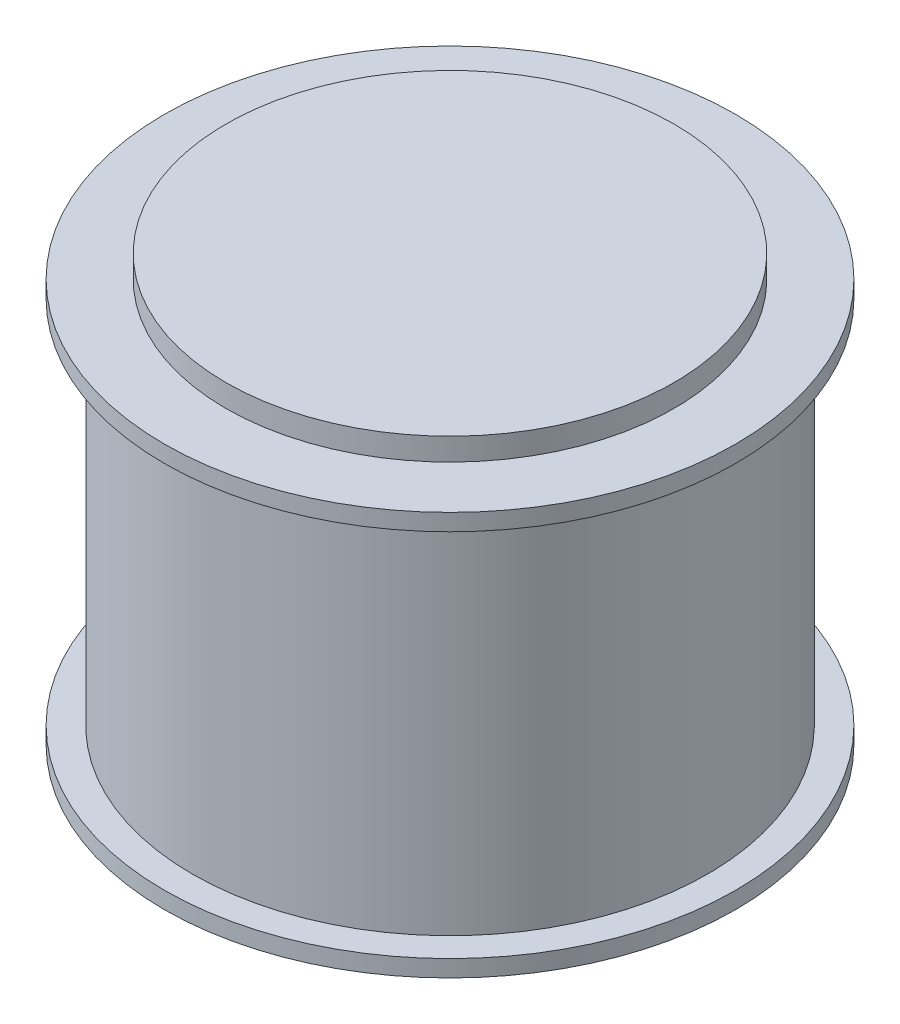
from build123d import *

# Parameters (mm, degrees)
SKETCH1_R           = 23
BOSS_EXTRUDE1_DEPTH = 33
SKETCH3_R           = 25.5
BOSS_EXTRUDE2_DEPTH = 1.5
SKETCH5_R           = 20
BOSS_EXTRUDE3_DEPTH = 1
SKETCH6_R           = 20
BOSS_EXTRUDE4_DEPTH = 1


with BuildPart() as part:
    # Sketch1 → Boss-Extrude1 (new body)
    with BuildSketch(Plane(origin=(0, 0, 0), x_dir=(1, 0, 0), z_dir=(0, 1, 0))):
        with Locations(Location((0, 0, 0), (0, 0, 270))):
            Circle(SKETCH1_R)
    extrude(amount=BOSS_EXTRUDE1_DEPTH)

    # Sketch3 → Boss-Extrude2 (add)
    with BuildSketch(Plane(origin=(0, 33, 0), x_dir=(1, 0, 0), z_dir=(0, 1, 0))):
        with Locations(Location((0, 0, 0), (0, 0, 270))):
            Circle(SKETCH3_R)
    boss_extrude2 = extrude(amount=BOSS_EXTRUDE2_DEPTH)

    # Sketch5 → Boss-Extrude3 (add)
    with BuildSketch(Plane(origin=(0, 34.5, 0), x_dir=(1, 0, 0), z_dir=(0, 1, 0))):
        with Locations(Location((0, 0, 0), (0, 0, 270))):
            Circle(SKETCH5_R)
    boss_extrude3 = extrude(amount=BOSS_EXTRUDE3_DEPTH)

    # Sketch6 → Boss-Extrude4 (add)
    with BuildSketch(Plane(origin=(0, 35.5, 0), x_dir=(1, 0, 0), z_dir=(0, 1, 0))):
        with Locations(Location((0, 0, 0), (0, 0, 270))):
            Circle(SKETCH6_R)
    boss_extrude4 = extrude(amount=BOSS_EXTRUDE4_DEPTH)

    # Mirror1: Boss-Extrude2, Boss-Extrude3, Boss-Extrude4 across plane
    add(boss_extrude2.mirror(Plane(origin=(0, 16.5, 0), x_dir=(0, 0, 1), z_dir=(0, -1, 0))))
    add(boss_extrude3.mirror(Plane(origin=(0, 16.5, 0), x_dir=(0, 0, 1), z_dir=(0, -1, 0))))
    add(boss_extrude4.mirror(Plane(origin=(0, 16.5, 0), x_dir=(0, 0, 1), z_dir=(0, -1, 0))))


solid = part.part
